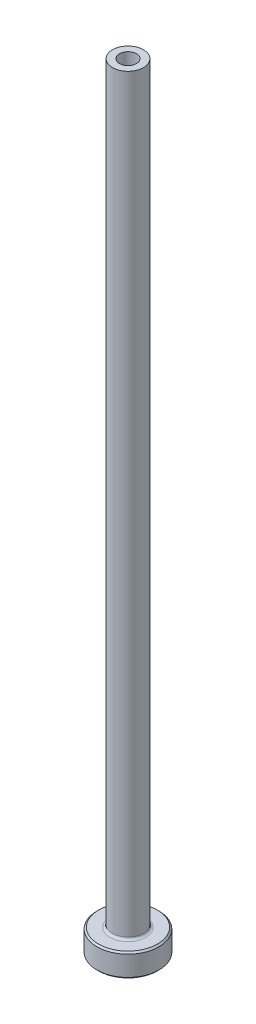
ISO-10303-21;
HEADER;
FILE_DESCRIPTION(('STEP AP214'),'2;1');
FILE_NAME('part.step','',(''),(''),'','','');
FILE_SCHEMA(('AUTOMOTIVE_DESIGN { 1 0 10303 214 1 1 1 1 }'));
ENDSEC;
DATA;
#1=APPLICATION_CONTEXT('core data for automotive mechanical design processes');
#2=APPLICATION_PROTOCOL_DEFINITION('international standard','automotive_design',2000,#1);
#3=PRODUCT_CONTEXT('',#1,'mechanical');
#4=PRODUCT('Part','Part','',(#3));
#5=PRODUCT_RELATED_PRODUCT_CATEGORY('part','',(#4));
#6=PRODUCT_DEFINITION_FORMATION('','',#4);
#7=PRODUCT_DEFINITION_CONTEXT('part definition',#1,'design');
#8=PRODUCT_DEFINITION('design','',#6,#7);
#9=PRODUCT_DEFINITION_SHAPE('','',#8);
#10=(LENGTH_UNIT() NAMED_UNIT(*) SI_UNIT(.MILLI.,.METRE.));
#11=(NAMED_UNIT(*) PLANE_ANGLE_UNIT() SI_UNIT($,.RADIAN.));
#12=(NAMED_UNIT(*) SI_UNIT($,.STERADIAN.) SOLID_ANGLE_UNIT());
#13=UNCERTAINTY_MEASURE_WITH_UNIT(LENGTH_MEASURE(1.E-05),#10,'distance_accuracy_value','');
#14=(GEOMETRIC_REPRESENTATION_CONTEXT(3) GLOBAL_UNCERTAINTY_ASSIGNED_CONTEXT((#13)) GLOBAL_UNIT_ASSIGNED_CONTEXT((#10,
#11,#12)) REPRESENTATION_CONTEXT('',''));
#15=CARTESIAN_POINT('',(0.,0.,0.));
#16=DIRECTION('',(0.,0.,1.));
#17=DIRECTION('',(1.,0.,0.));
#18=AXIS2_PLACEMENT_3D('',#15,#16,#17);
#19=CARTESIAN_POINT('',(0.,92.1876809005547,0.));
#20=DIRECTION('',(0.,1.,0.));
#21=DIRECTION('',(0.,0.,1.));
#22=AXIS2_PLACEMENT_3D('',#19,#20,#21);
#23=CYLINDRICAL_SURFACE('',#22,1.1);
#24=CARTESIAN_POINT('',(0.,100.,0.));
#25=DIRECTION('',(0.,1.,0.));
#26=DIRECTION('',(0.,0.,1.));
#27=AXIS2_PLACEMENT_3D('',#24,#25,#26);
#28=CIRCLE('',#27,1.1);
#29=CARTESIAN_POINT('',(0.,100.,1.1));
#30=VERTEX_POINT('',#29);
#31=EDGE_CURVE('E62',#30,#30,#28,.T.);
#32=ORIENTED_EDGE('',*,*,#31,.T.);
#33=EDGE_LOOP('',(#32));
#34=FACE_BOUND('',#33,.T.);
#35=CARTESIAN_POINT('',(0.,65.,0.));
#36=DIRECTION('',(0.,1.,0.));
#37=DIRECTION('',(0.,0.,1.));
#38=AXIS2_PLACEMENT_3D('',#35,#36,#37);
#39=CIRCLE('',#38,1.1);
#40=CARTESIAN_POINT('',(0.,65.,1.1));
#41=VERTEX_POINT('',#40);
#42=EDGE_CURVE('E71',#41,#41,#39,.T.);
#43=ORIENTED_EDGE('',*,*,#42,.F.);
#44=EDGE_LOOP('',(#43));
#45=FACE_BOUND('',#44,.T.);
#46=ADVANCED_FACE('F30',(#34,#45),#23,.F.);
#47=CARTESIAN_POINT('',(-1.1,100.,0.));
#48=DIRECTION('',(0.,1.,0.));
#49=DIRECTION('',(0.,0.,1.));
#50=AXIS2_PLACEMENT_3D('',#47,#48,#49);
#51=PLANE('',#50);
#52=CARTESIAN_POINT('',(0.,100.,0.));
#53=DIRECTION('',(0.,1.,0.));
#54=DIRECTION('',(0.,0.,1.));
#55=AXIS2_PLACEMENT_3D('',#52,#53,#54);
#56=CIRCLE('',#55,2.);
#57=CARTESIAN_POINT('',(0.,100.,2.));
#58=VERTEX_POINT('',#57);
#59=EDGE_CURVE('E65',#58,#58,#56,.T.);
#60=ORIENTED_EDGE('',*,*,#59,.T.);
#61=EDGE_LOOP('',(#60));
#62=FACE_BOUND('',#61,.T.);
#63=ORIENTED_EDGE('',*,*,#31,.F.);
#64=EDGE_LOOP('',(#63));
#65=FACE_BOUND('',#64,.T.);
#66=ADVANCED_FACE('F79',(#62,#65),#51,.T.);
#67=CARTESIAN_POINT('',(0.,92.1876809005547,0.));
#68=DIRECTION('',(0.,1.,0.));
#69=DIRECTION('',(0.,0.,1.));
#70=AXIS2_PLACEMENT_3D('',#67,#68,#69);
#71=CYLINDRICAL_SURFACE('',#70,1.99999999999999);
#72=CARTESIAN_POINT('',(0.,3.3,0.));
#73=DIRECTION('',(0.,1.,0.));
#74=DIRECTION('',(0.,0.,1.));
#75=AXIS2_PLACEMENT_3D('',#72,#73,#74);
#76=CIRCLE('',#75,1.99999999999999);
#77=CARTESIAN_POINT('',(0.,3.3,1.99999999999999));
#78=VERTEX_POINT('',#77);
#79=EDGE_CURVE('E59',#78,#78,#76,.T.);
#80=ORIENTED_EDGE('',*,*,#79,.T.);
#81=EDGE_LOOP('',(#80));
#82=FACE_BOUND('',#81,.T.);
#83=ORIENTED_EDGE('',*,*,#59,.F.);
#84=EDGE_LOOP('',(#83));
#85=FACE_BOUND('',#84,.T.);
#86=ADVANCED_FACE('F85',(#82,#85),#71,.T.);
#87=CARTESIAN_POINT('',(-1.99999999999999,3.,0.));
#88=DIRECTION('',(0.,1.,0.));
#89=DIRECTION('',(0.,0.,1.));
#90=AXIS2_PLACEMENT_3D('',#87,#88,#89);
#91=PLANE('',#90);
#92=CARTESIAN_POINT('',(0.,3.,0.));
#93=DIRECTION('',(0.,1.,0.));
#94=DIRECTION('',(0.,0.,1.));
#95=AXIS2_PLACEMENT_3D('',#92,#93,#94);
#96=CIRCLE('',#95,3.8);
#97=CARTESIAN_POINT('',(0.,3.,3.8));
#98=VERTEX_POINT('',#97);
#99=EDGE_CURVE('E53',#98,#98,#96,.T.);
#100=ORIENTED_EDGE('',*,*,#99,.T.);
#101=EDGE_LOOP('',(#100));
#102=FACE_BOUND('',#101,.T.);
#103=CARTESIAN_POINT('',(0.,3.,0.));
#104=DIRECTION('',(0.,1.,0.));
#105=DIRECTION('',(0.,0.,1.));
#106=AXIS2_PLACEMENT_3D('',#103,#104,#105);
#107=CIRCLE('',#106,2.29999999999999);
#108=CARTESIAN_POINT('',(0.,3.,2.29999999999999));
#109=VERTEX_POINT('',#108);
#110=EDGE_CURVE('E56',#109,#109,#107,.F.);
#111=ORIENTED_EDGE('',*,*,#110,.T.);
#112=EDGE_LOOP('',(#111));
#113=FACE_BOUND('',#112,.T.);
#114=ADVANCED_FACE('F111',(#102,#113),#91,.T.);
#115=CARTESIAN_POINT('',(0.,92.1876809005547,0.));
#116=DIRECTION('',(0.,1.,0.));
#117=DIRECTION('',(0.,0.,1.));
#118=AXIS2_PLACEMENT_3D('',#115,#116,#117);
#119=CYLINDRICAL_SURFACE('',#118,3.99999999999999);
#120=CARTESIAN_POINT('',(0.,2.8,0.));
#121=DIRECTION('',(0.,1.,0.));
#122=DIRECTION('',(0.,0.,1.));
#123=AXIS2_PLACEMENT_3D('',#120,#121,#122);
#124=CIRCLE('',#123,3.99999999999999);
#125=CARTESIAN_POINT('',(0.,2.8,3.99999999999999));
#126=VERTEX_POINT('',#125);
#127=EDGE_CURVE('E45',#126,#126,#124,.F.);
#128=ORIENTED_EDGE('',*,*,#127,.T.);
#129=EDGE_LOOP('',(#128));
#130=FACE_BOUND('',#129,.T.);
#131=CARTESIAN_POINT('',(0.,0.20000000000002,0.));
#132=DIRECTION('',(0.,-1.,0.));
#133=DIRECTION('',(0.,0.,-1.));
#134=AXIS2_PLACEMENT_3D('',#131,#132,#133);
#135=CIRCLE('',#134,3.99999999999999);
#136=CARTESIAN_POINT('',(0.,0.20000000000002,-3.99999999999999));
#137=VERTEX_POINT('',#136);
#138=EDGE_CURVE('E50',#137,#137,#135,.F.);
#139=ORIENTED_EDGE('',*,*,#138,.T.);
#140=EDGE_LOOP('',(#139));
#141=FACE_BOUND('',#140,.T.);
#142=ADVANCED_FACE('F108',(#130,#141),#119,.T.);
#143=CARTESIAN_POINT('',(-3.99999999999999,0.,0.));
#144=DIRECTION('',(0.,-1.,0.));
#145=DIRECTION('',(0.,0.,-1.));
#146=AXIS2_PLACEMENT_3D('',#143,#144,#145);
#147=PLANE('',#146);
#148=CARTESIAN_POINT('',(0.,0.,0.));
#149=DIRECTION('',(0.,-1.,0.));
#150=DIRECTION('',(0.,0.,-1.));
#151=AXIS2_PLACEMENT_3D('',#148,#149,#150);
#152=CIRCLE('',#151,1.84999999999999);
#153=CARTESIAN_POINT('',(0.,0.,-1.84999999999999));
#154=VERTEX_POINT('',#153);
#155=EDGE_CURVE('E37',#154,#154,#152,.F.);
#156=ORIENTED_EDGE('',*,*,#155,.T.);
#157=EDGE_LOOP('',(#156));
#158=FACE_BOUND('',#157,.T.);
#159=CARTESIAN_POINT('',(0.,0.,0.));
#160=DIRECTION('',(0.,-1.,0.));
#161=DIRECTION('',(0.,0.,-1.));
#162=AXIS2_PLACEMENT_3D('',#159,#160,#161);
#163=CIRCLE('',#162,3.79999999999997);
#164=CARTESIAN_POINT('',(0.,0.,-3.79999999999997));
#165=VERTEX_POINT('',#164);
#166=EDGE_CURVE('E41',#165,#165,#163,.T.);
#167=ORIENTED_EDGE('',*,*,#166,.T.);
#168=EDGE_LOOP('',(#167));
#169=FACE_BOUND('',#168,.T.);
#170=ADVANCED_FACE('F110',(#158,#169),#147,.T.);
#171=CARTESIAN_POINT('',(0.,92.1876809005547,0.));
#172=DIRECTION('',(0.,1.,0.));
#173=DIRECTION('',(0.,0.,1.));
#174=AXIS2_PLACEMENT_3D('',#171,#172,#173);
#175=CYLINDRICAL_SURFACE('',#174,1.34999999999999);
#176=CARTESIAN_POINT('',(0.,0.5,0.));
#177=DIRECTION('',(0.,-1.,0.));
#178=DIRECTION('',(0.,0.,-1.));
#179=AXIS2_PLACEMENT_3D('',#176,#177,#178);
#180=CIRCLE('',#179,1.34999999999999);
#181=CARTESIAN_POINT('',(0.,0.5,-1.34999999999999));
#182=VERTEX_POINT('',#181);
#183=EDGE_CURVE('E10',#182,#182,#180,.T.);
#184=ORIENTED_EDGE('',*,*,#183,.T.);
#185=EDGE_LOOP('',(#184));
#186=FACE_BOUND('',#185,.T.);
#187=CARTESIAN_POINT('',(0.,53.,0.));
#188=DIRECTION('',(0.,1.,0.));
#189=DIRECTION('',(0.,0.,1.));
#190=AXIS2_PLACEMENT_3D('',#187,#188,#189);
#191=CIRCLE('',#190,1.35);
#192=CARTESIAN_POINT('',(0.,53.,1.35));
#193=VERTEX_POINT('',#192);
#194=EDGE_CURVE('E68',#193,#193,#191,.T.);
#195=ORIENTED_EDGE('',*,*,#194,.T.);
#196=EDGE_LOOP('',(#195));
#197=FACE_BOUND('',#196,.T.);
#198=ADVANCED_FACE('F118',(#186,#197),#175,.F.);
#199=CARTESIAN_POINT('',(0.,53.,0.));
#200=DIRECTION('',(0.,-1.,0.));
#201=DIRECTION('',(0.,0.,-1.));
#202=AXIS2_PLACEMENT_3D('',#199,#200,#201);
#203=CONICAL_SURFACE('',#202,1.35,0.0208303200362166);
#204=ORIENTED_EDGE('',*,*,#42,.T.);
#205=EDGE_LOOP('',(#204));
#206=FACE_BOUND('',#205,.T.);
#207=ORIENTED_EDGE('',*,*,#194,.F.);
#208=EDGE_LOOP('',(#207));
#209=FACE_BOUND('',#208,.T.);
#210=ADVANCED_FACE('F75',(#206,#209),#203,.F.);
#211=CARTESIAN_POINT('',(0.,3.3,0.));
#212=DIRECTION('',(0.,1.,0.));
#213=DIRECTION('',(0.,0.,1.));
#214=AXIS2_PLACEMENT_3D('',#211,#212,#213);
#215=TOROIDAL_SURFACE('',#214,2.29999999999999,0.3);
#216=ORIENTED_EDGE('',*,*,#110,.F.);
#217=EDGE_LOOP('',(#216));
#218=FACE_BOUND('',#217,.T.);
#219=ORIENTED_EDGE('',*,*,#79,.F.);
#220=EDGE_LOOP('',(#219));
#221=FACE_BOUND('',#220,.T.);
#222=ADVANCED_FACE('F90',(#218,#221),#215,.F.);
#223=CARTESIAN_POINT('',(0.,3.,0.));
#224=DIRECTION('',(0.,-1.,0.));
#225=DIRECTION('',(0.,0.,-1.));
#226=AXIS2_PLACEMENT_3D('',#223,#224,#225);
#227=CONICAL_SURFACE('',#226,3.8,0.785398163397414);
#228=ORIENTED_EDGE('',*,*,#127,.F.);
#229=EDGE_LOOP('',(#228));
#230=FACE_BOUND('',#229,.T.);
#231=ORIENTED_EDGE('',*,*,#99,.F.);
#232=EDGE_LOOP('',(#231));
#233=FACE_BOUND('',#232,.T.);
#234=ADVANCED_FACE('F93',(#230,#233),#227,.T.);
#235=CARTESIAN_POINT('',(0.,0.20000000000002,0.));
#236=DIRECTION('',(0.,1.,0.));
#237=DIRECTION('',(0.,0.,1.));
#238=AXIS2_PLACEMENT_3D('',#235,#236,#237);
#239=CONICAL_SURFACE('',#238,3.99999999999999,0.785398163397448);
#240=ORIENTED_EDGE('',*,*,#166,.F.);
#241=EDGE_LOOP('',(#240));
#242=FACE_BOUND('',#241,.T.);
#243=ORIENTED_EDGE('',*,*,#138,.F.);
#244=EDGE_LOOP('',(#243));
#245=FACE_BOUND('',#244,.T.);
#246=ADVANCED_FACE('F96',(#242,#245),#239,.T.);
#247=CARTESIAN_POINT('',(0.,0.,0.));
#248=DIRECTION('',(0.,-1.,0.));
#249=DIRECTION('',(0.,0.,-1.));
#250=AXIS2_PLACEMENT_3D('',#247,#248,#249);
#251=CONICAL_SURFACE('',#250,1.84999999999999,0.785398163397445);
#252=ORIENTED_EDGE('',*,*,#183,.F.);
#253=EDGE_LOOP('',(#252));
#254=FACE_BOUND('',#253,.T.);
#255=ORIENTED_EDGE('',*,*,#155,.F.);
#256=EDGE_LOOP('',(#255));
#257=FACE_BOUND('',#256,.T.);
#258=ADVANCED_FACE('F32',(#254,#257),#251,.F.);
#259=CLOSED_SHELL('',(#46,#66,#86,#114,#142,#170,#198,#210,#222,#234,#246,#258));
#260=MANIFOLD_SOLID_BREP('B2',#259);
#261=ADVANCED_BREP_SHAPE_REPRESENTATION('',(#18,#260),#14);
#262=SHAPE_DEFINITION_REPRESENTATION(#9,#261);
ENDSEC;
END-ISO-10303-21;
